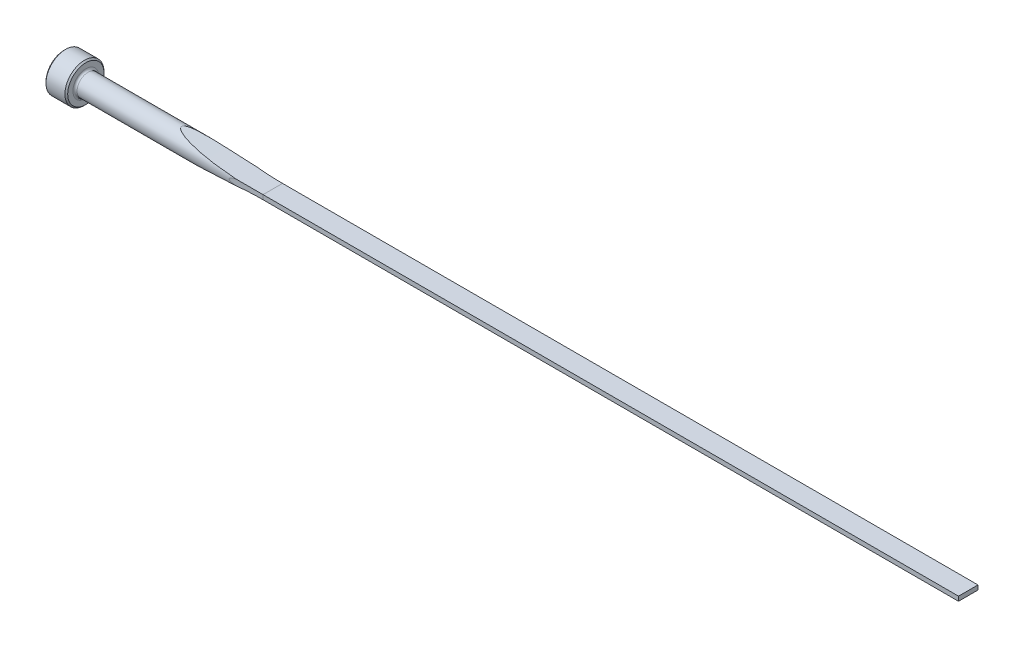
ISO-10303-21;
HEADER;
FILE_DESCRIPTION(('STEP AP214'),'2;1');
FILE_NAME('part.step','',(''),(''),'','','');
FILE_SCHEMA(('AUTOMOTIVE_DESIGN { 1 0 10303 214 1 1 1 1 }'));
ENDSEC;
DATA;
#1=APPLICATION_CONTEXT('core data for automotive mechanical design processes');
#2=APPLICATION_PROTOCOL_DEFINITION('international standard','automotive_design',2000,#1);
#3=PRODUCT_CONTEXT('',#1,'mechanical');
#4=PRODUCT('Part','Part','',(#3));
#5=PRODUCT_RELATED_PRODUCT_CATEGORY('part','',(#4));
#6=PRODUCT_DEFINITION_FORMATION('','',#4);
#7=PRODUCT_DEFINITION_CONTEXT('part definition',#1,'design');
#8=PRODUCT_DEFINITION('design','',#6,#7);
#9=PRODUCT_DEFINITION_SHAPE('','',#8);
#10=(LENGTH_UNIT() NAMED_UNIT(*) SI_UNIT(.MILLI.,.METRE.));
#11=(NAMED_UNIT(*) PLANE_ANGLE_UNIT() SI_UNIT($,.RADIAN.));
#12=(NAMED_UNIT(*) SI_UNIT($,.STERADIAN.) SOLID_ANGLE_UNIT());
#13=UNCERTAINTY_MEASURE_WITH_UNIT(LENGTH_MEASURE(1.E-05),#10,'distance_accuracy_value','');
#14=(GEOMETRIC_REPRESENTATION_CONTEXT(3) GLOBAL_UNCERTAINTY_ASSIGNED_CONTEXT((#13)) GLOBAL_UNIT_ASSIGNED_CONTEXT((#10,
#11,#12)) REPRESENTATION_CONTEXT('',''));
#15=CARTESIAN_POINT('',(0.,0.,0.));
#16=DIRECTION('',(0.,0.,1.));
#17=DIRECTION('',(1.,0.,0.));
#18=AXIS2_PLACEMENT_3D('',#15,#16,#17);
#19=CARTESIAN_POINT('',(0.,0.,0.));
#20=DIRECTION('',(-1.,0.,0.));
#21=DIRECTION('',(0.,0.,1.));
#22=AXIS2_PLACEMENT_3D('',#19,#20,#21);
#23=CYLINDRICAL_SURFACE('',#22,1.9812);
#24=CARTESIAN_POINT('',(4.3434,0.,0.));
#25=DIRECTION('',(-1.,0.,0.));
#26=DIRECTION('',(0.,0.,1.));
#27=AXIS2_PLACEMENT_3D('',#24,#25,#26);
#28=CIRCLE('',#27,1.9812);
#29=CARTESIAN_POINT('',(4.3434,0.,1.9812));
#30=VERTEX_POINT('',#29);
#31=EDGE_CURVE('E152',#30,#30,#28,.F.);
#32=ORIENTED_EDGE('',*,*,#31,.T.);
#33=EDGE_LOOP('',(#32));
#34=FACE_BOUND('',#33,.T.);
#35=CARTESIAN_POINT('',(38.1,0.873996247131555,1.77799999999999));
#36=CARTESIAN_POINT('',(37.9334542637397,0.873989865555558,1.77799993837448));
#37=CARTESIAN_POINT('',(37.7669097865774,0.873044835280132,1.77846802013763));
#38=CARTESIAN_POINT('',(37.4338428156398,0.869223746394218,1.78033991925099));
#39=CARTESIAN_POINT('',(37.2673203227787,0.866347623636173,1.78174376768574));
#40=CARTESIAN_POINT('',(36.7674068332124,0.854732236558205,1.78736286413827));
#41=CARTESIAN_POINT('',(36.4340948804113,0.8430056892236,1.7929856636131));
#42=CARTESIAN_POINT('',(35.7727863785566,0.810634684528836,1.80785962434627));
#43=CARTESIAN_POINT('',(35.4447825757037,0.79012144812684,1.81705721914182));
#44=CARTESIAN_POINT('',(34.9536671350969,0.750641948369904,1.83354371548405));
#45=CARTESIAN_POINT('',(34.7901577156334,0.736036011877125,1.83948544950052));
#46=CARTESIAN_POINT('',(34.4635315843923,0.703289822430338,1.85225599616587));
#47=CARTESIAN_POINT('',(34.3004148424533,0.685149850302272,1.85908473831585));
#48=CARTESIAN_POINT('',(34.0296562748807,0.651228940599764,1.87116478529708));
#49=CARTESIAN_POINT('',(33.9218452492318,0.636713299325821,1.8761721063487));
#50=CARTESIAN_POINT('',(33.7065408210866,0.605233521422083,1.88656384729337));
#51=CARTESIAN_POINT('',(33.5990475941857,0.588268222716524,1.8919484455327));
#52=CARTESIAN_POINT('',(33.3835275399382,0.551010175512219,1.9031350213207));
#53=CARTESIAN_POINT('',(33.2755064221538,0.530685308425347,1.90894069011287));
#54=CARTESIAN_POINT('',(33.0604889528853,0.485692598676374,1.92088824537));
#55=CARTESIAN_POINT('',(32.9534914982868,0.461030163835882,1.92702970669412));
#56=CARTESIAN_POINT('',(32.7938896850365,0.418829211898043,1.93647603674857));
#57=CARTESIAN_POINT('',(32.7406123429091,0.403818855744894,1.93967803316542));
#58=CARTESIAN_POINT('',(32.6346066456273,0.371424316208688,1.94614386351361));
#59=CARTESIAN_POINT('',(32.5818801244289,0.354033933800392,1.94940783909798));
#60=CARTESIAN_POINT('',(32.4782386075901,0.316094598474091,1.95591437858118));
#61=CARTESIAN_POINT('',(32.4273101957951,0.295581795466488,1.95915679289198));
#62=CARTESIAN_POINT('',(32.3278405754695,0.249491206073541,1.9655736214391));
#63=CARTESIAN_POINT('',(32.2792877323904,0.223942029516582,1.96874831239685));
#64=CARTESIAN_POINT('',(32.2167619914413,0.181702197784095,1.97288277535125));
#65=CARTESIAN_POINT('',(32.1999648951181,0.169297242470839,1.97399869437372));
#66=CARTESIAN_POINT('',(32.1681376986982,0.142414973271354,1.97612145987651));
#67=CARTESIAN_POINT('',(32.1530993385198,0.127948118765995,1.97712881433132));
#68=CARTESIAN_POINT('',(32.1334076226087,0.104576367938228,1.97845199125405));
#69=CARTESIAN_POINT('',(32.1274666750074,0.0967736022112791,1.97885188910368));
#70=CARTESIAN_POINT('',(32.116621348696,0.0804504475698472,1.97958282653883));
#71=CARTESIAN_POINT('',(32.1117177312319,0.0719295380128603,1.9799138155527));
#72=CARTESIAN_POINT('',(32.1032905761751,0.0540450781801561,1.9804831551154));
#73=CARTESIAN_POINT('',(32.0997893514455,0.0446706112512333,1.98072000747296));
#74=CARTESIAN_POINT('',(32.0947628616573,0.0254116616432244,1.98106017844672));
#75=CARTESIAN_POINT('',(32.0932312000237,0.0155289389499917,1.98116392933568));
#76=CARTESIAN_POINT('',(32.0924621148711,-0.00283989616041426,1.98121601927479));
#77=CARTESIAN_POINT('',(32.0929156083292,-0.0113136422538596,1.98118529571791));
#78=CARTESIAN_POINT('',(32.0953671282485,-0.0280374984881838,1.98101929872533));
#79=CARTESIAN_POINT('',(32.0973672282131,-0.0362872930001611,1.98088388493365));
#80=CARTESIAN_POINT('',(32.1032599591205,-0.0541083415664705,1.98048527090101));
#81=CARTESIAN_POINT('',(32.1074720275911,-0.0635712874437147,1.98020051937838));
#82=CARTESIAN_POINT('',(32.1173271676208,-0.081709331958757,1.97953524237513));
#83=CARTESIAN_POINT('',(32.1229731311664,-0.0903827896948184,1.97915452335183));
#84=CARTESIAN_POINT('',(32.1399709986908,-0.113337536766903,1.97801031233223));
#85=CARTESIAN_POINT('',(32.1523792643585,-0.126821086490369,1.97717711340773));
#86=CARTESIAN_POINT('',(32.178895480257,-0.151968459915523,1.97540307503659));
#87=CARTESIAN_POINT('',(32.1930088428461,-0.163626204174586,1.97446189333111));
#88=CARTESIAN_POINT('',(32.2308983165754,-0.19208509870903,1.97194504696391));
#89=CARTESIAN_POINT('',(32.2554459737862,-0.207842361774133,1.97032379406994));
#90=CARTESIAN_POINT('',(32.3058684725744,-0.237095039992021,1.96701597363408));
#91=CARTESIAN_POINT('',(32.331746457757,-0.250584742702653,1.9653292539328));
#92=CARTESIAN_POINT('',(32.4107777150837,-0.288767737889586,1.96021411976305));
#93=CARTESIAN_POINT('',(32.4650936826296,-0.311024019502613,1.95674636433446));
#94=CARTESIAN_POINT('',(32.5833217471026,-0.354812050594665,1.94931073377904));
#95=CARTESIAN_POINT('',(32.6474477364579,-0.375730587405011,1.94534614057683));
#96=CARTESIAN_POINT('',(32.7766973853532,-0.41429027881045,1.93749827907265));
#97=CARTESIAN_POINT('',(32.8418214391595,-0.431930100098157,1.93361504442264));
#98=CARTESIAN_POINT('',(33.0383860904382,-0.481456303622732,1.92211396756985));
#99=CARTESIAN_POINT('',(33.1707045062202,-0.509845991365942,1.91466459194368));
#100=CARTESIAN_POINT('',(33.4364278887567,-0.560951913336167,1.90030665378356));
#101=CARTESIAN_POINT('',(33.5698330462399,-0.583667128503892,1.89339818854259));
#102=CARTESIAN_POINT('',(33.8371090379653,-0.624985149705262,1.88016424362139));
#103=CARTESIAN_POINT('',(33.9709789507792,-0.643593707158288,1.87383795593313));
#104=CARTESIAN_POINT('',(34.2612886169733,-0.680513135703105,1.86077894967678));
#105=CARTESIAN_POINT('',(34.4178028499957,-0.698266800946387,1.85415178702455));
#106=CARTESIAN_POINT('',(34.7312113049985,-0.730437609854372,1.84171312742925));
#107=CARTESIAN_POINT('',(34.8881055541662,-0.744854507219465,1.83590169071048));
#108=CARTESIAN_POINT('',(35.3593917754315,-0.78401015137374,1.81969752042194));
#109=CARTESIAN_POINT('',(35.674170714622,-0.804628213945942,1.81054467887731));
#110=CARTESIAN_POINT('',(36.303676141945,-0.83743822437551,1.79559337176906));
#111=CARTESIAN_POINT('',(36.6184017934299,-0.849644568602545,1.78978917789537));
#112=CARTESIAN_POINT('',(37.2480072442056,-0.866841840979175,1.78152544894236));
#113=CARTESIAN_POINT('',(37.562886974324,-0.8718348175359,1.77906496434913));
#114=CARTESIAN_POINT('',(37.9518520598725,-0.8738064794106,1.77809255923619));
#115=CARTESIAN_POINT('',(38.0259264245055,-0.873993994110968,1.77799996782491));
#116=CARTESIAN_POINT('',(38.1,-0.873996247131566,1.77799999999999));
#117=B_SPLINE_CURVE_WITH_KNOTS('',3,(#35,#36,#37,#38,#39,#40,#41,#42,#43,#44,#45,#46,#47,#48,
#49,#50,#51,#52,#53,#54,#55,#56,#57,#58,#59,#60,#61,#62,#63,#64,#65,#66,#67,#68,#69,#70,#71,#72,
#73,#74,#75,#76,#77,#78,#79,#80,#81,#82,#83,#84,#85,#86,#87,#88,#89,#90,#91,#92,#93,#94,#95,#96,
#97,#98,#99,#100,#101,#102,#103,#104,#105,#106,#107,#108,#109,#110,#111,#112,#113,#114,#115,
#116),.UNSPECIFIED.,.F.,.F.,(4,2,2,2,2,2,2,2,2,2,2,2,2,2,2,2,2,2,2,2,2,2,2,2,2,2,2,2,2,2,2,2,2,
2,2,2,2,2,2,2,4),(0.,0.499631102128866,0.999278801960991,1.9998489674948,2.98597077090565,
3.47874557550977,3.97148123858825,4.29815737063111,4.62498898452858,4.95514810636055,
5.28489848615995,5.4512016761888,5.61794656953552,5.78289019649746,5.94692252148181,
6.00956538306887,6.07190109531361,6.10128690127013,6.1306941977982,6.1605523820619,
6.1903133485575,6.21561974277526,6.24096012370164,6.27187252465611,6.30284777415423,
6.35756673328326,6.41246418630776,6.49988097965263,6.58751479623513,6.76361391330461,
6.96621737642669,7.16890304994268,7.57526706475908,7.98170400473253,8.38756806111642,
8.86049226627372,9.33345136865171,10.2800238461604,11.2249722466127,12.1696522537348,
12.3918748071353),.UNSPECIFIED.);
#118=CARTESIAN_POINT('',(33.3055412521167,0.535778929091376,1.90737892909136));
#119=VERTEX_POINT('',#118);
#120=CARTESIAN_POINT('',(33.3055412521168,-0.535778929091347,1.90737892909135));
#121=VERTEX_POINT('',#120);
#122=EDGE_CURVE('E155',#119,#121,#117,.T.);
#123=ORIENTED_EDGE('',*,*,#122,.F.);
#124=CARTESIAN_POINT('',(38.1,0.406399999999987,1.93907000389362));
#125=CARTESIAN_POINT('',(37.7692956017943,0.406399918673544,1.93905843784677));
#126=CARTESIAN_POINT('',(37.4385913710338,0.408245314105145,1.93868298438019));
#127=CARTESIAN_POINT('',(36.7772104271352,0.415626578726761,1.93712001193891));
#128=CARTESIAN_POINT('',(36.4465337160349,0.421162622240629,1.93593245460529));
#129=CARTESIAN_POINT('',(35.7860594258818,0.435906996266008,1.93266489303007));
#130=CARTESIAN_POINT('',(35.456261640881,0.445106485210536,1.93058703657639));
#131=CARTESIAN_POINT('',(34.796814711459,0.467175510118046,1.92536360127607));
#132=CARTESIAN_POINT('',(34.4671655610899,0.480044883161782,1.92221806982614));
#133=CARTESIAN_POINT('',(33.4782152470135,0.524167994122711,1.9108535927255));
#134=CARTESIAN_POINT('',(32.8191651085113,0.560931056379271,1.90070770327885));
#135=CARTESIAN_POINT('',(31.8313681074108,0.627071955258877,1.87948200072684));
#136=CARTESIAN_POINT('',(31.5021769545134,0.650956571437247,1.87140376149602));
#137=CARTESIAN_POINT('',(30.8441537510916,0.702384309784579,1.85271790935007));
#138=CARTESIAN_POINT('',(30.5153216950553,0.729927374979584,1.84211033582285));
#139=CARTESIAN_POINT('',(29.8563841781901,0.788815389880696,1.81767575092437));
#140=CARTESIAN_POINT('',(29.5262810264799,0.82017942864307,1.8038322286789));
#141=CARTESIAN_POINT('',(28.8666409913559,0.886577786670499,1.77214226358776));
#142=CARTESIAN_POINT('',(28.5371040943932,0.921612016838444,1.75429591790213));
#143=CARTESIAN_POINT('',(27.8790189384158,0.995296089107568,1.71356755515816));
#144=CARTESIAN_POINT('',(27.5504700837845,1.03394288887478,1.69068975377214));
#145=CARTESIAN_POINT('',(26.8943469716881,1.11483240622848,1.63848108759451));
#146=CARTESIAN_POINT('',(26.5667726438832,1.15707485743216,1.6091507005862));
#147=CARTESIAN_POINT('',(25.9110283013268,1.2453472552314,1.54187804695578));
#148=CARTESIAN_POINT('',(25.5828658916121,1.29139778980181,1.50388671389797));
#149=CARTESIAN_POINT('',(25.0918351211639,1.36309382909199,1.43811303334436));
#150=CARTESIAN_POINT('',(24.9281937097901,1.38745545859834,1.41469558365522));
#151=CARTESIAN_POINT('',(24.6015940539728,1.43700653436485,1.3643380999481));
#152=CARTESIAN_POINT('',(24.4386357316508,1.46219588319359,1.33739847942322));
#153=CARTESIAN_POINT('',(24.1147309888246,1.51318307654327,1.27941902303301));
#154=CARTESIAN_POINT('',(23.9537784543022,1.53897548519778,1.24840893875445));
#155=CARTESIAN_POINT('',(23.6330248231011,1.59127560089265,1.18102348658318));
#156=CARTESIAN_POINT('',(23.4732243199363,1.61778364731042,1.14464553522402));
#157=CARTESIAN_POINT('',(23.1559514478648,1.67129760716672,1.06500559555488));
#158=CARTESIAN_POINT('',(22.9984731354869,1.69830158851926,1.02176672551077));
#159=CARTESIAN_POINT('',(22.7646367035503,1.73903791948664,0.94955302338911));
#160=CARTESIAN_POINT('',(22.687119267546,1.75264947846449,0.924267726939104));
#161=CARTESIAN_POINT('',(22.5331529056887,1.77989331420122,0.870657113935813));
#162=CARTESIAN_POINT('',(22.4567037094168,1.79352558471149,0.842332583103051));
#163=CARTESIAN_POINT('',(22.332862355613,1.81577325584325,0.792820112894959));
#164=CARTESIAN_POINT('',(22.2850144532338,1.82441008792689,0.772783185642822));
#165=CARTESIAN_POINT('',(22.1901094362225,1.84162019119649,0.730824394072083));
#166=CARTESIAN_POINT('',(22.1430526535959,1.85019343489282,0.708901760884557));
#167=CARTESIAN_POINT('',(22.0502093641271,1.86718431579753,0.662854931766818));
#168=CARTESIAN_POINT('',(22.0044188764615,1.87560240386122,0.638738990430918));
#169=CARTESIAN_POINT('',(21.9144099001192,1.89222058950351,0.587688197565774));
#170=CARTESIAN_POINT('',(21.8701903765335,1.90042082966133,0.560755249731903));
#171=CARTESIAN_POINT('',(21.7937216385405,1.91465872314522,0.509677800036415));
#172=CARTESIAN_POINT('',(21.7610069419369,1.92076989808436,0.486256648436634));
#173=CARTESIAN_POINT('',(21.6975363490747,1.93266121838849,0.436609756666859));
#174=CARTESIAN_POINT('',(21.6667856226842,1.93844048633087,0.410377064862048));
#175=CARTESIAN_POINT('',(21.6080567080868,1.94950726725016,0.354133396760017));
#176=CARTESIAN_POINT('',(21.5801166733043,1.95478796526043,0.32408045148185));
#177=CARTESIAN_POINT('',(21.5295061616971,1.96437466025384,0.259681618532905));
#178=CARTESIAN_POINT('',(21.506811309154,1.96868516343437,0.225356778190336));
#179=CARTESIAN_POINT('',(21.4781800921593,1.97413096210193,0.168450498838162));
#180=CARTESIAN_POINT('',(21.4692784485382,1.97582600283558,0.147430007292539));
#181=CARTESIAN_POINT('',(21.4548493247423,1.97857503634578,0.104216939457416));
#182=CARTESIAN_POINT('',(21.4493175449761,1.97962984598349,0.082025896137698));
#183=CARTESIAN_POINT('',(21.4421972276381,1.98098776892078,0.0368096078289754));
#184=CARTESIAN_POINT('',(21.4406380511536,1.98128528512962,0.0137794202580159));
#185=CARTESIAN_POINT('',(21.441756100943,1.98107199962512,-0.0321780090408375));
#186=CARTESIAN_POINT('',(21.4444344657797,1.9805609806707,-0.0551052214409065));
#187=CARTESIAN_POINT('',(21.4533059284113,1.97886943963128,-0.0982815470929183));
#188=CARTESIAN_POINT('',(21.4591973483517,1.97774638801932,-0.118597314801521));
#189=CARTESIAN_POINT('',(21.4737401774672,1.97497644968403,-0.15816238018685));
#190=CARTESIAN_POINT('',(21.4823927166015,1.97332934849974,-0.177411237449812));
#191=CARTESIAN_POINT('',(21.5089711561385,1.96827515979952,-0.228241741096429));
#192=CARTESIAN_POINT('',(21.5290704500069,1.96445818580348,-0.258638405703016));
#193=CARTESIAN_POINT('',(21.5734839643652,1.95604348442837,-0.316061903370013));
#194=CARTESIAN_POINT('',(21.597813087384,1.95144299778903,-0.34307622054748));
#195=CARTESIAN_POINT('',(21.6553284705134,1.94059533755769,-0.400355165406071));
#196=CARTESIAN_POINT('',(21.6892419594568,1.93421737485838,-0.429853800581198));
#197=CARTESIAN_POINT('',(21.7596931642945,1.92101412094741,-0.485462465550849));
#198=CARTESIAN_POINT('',(21.796235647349,1.9141880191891,-0.511566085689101));
#199=CARTESIAN_POINT('',(21.8712226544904,1.90023175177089,-0.561194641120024));
#200=CARTESIAN_POINT('',(21.9096756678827,1.89310025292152,-0.584706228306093));
#201=CARTESIAN_POINT('',(21.9877604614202,1.87867376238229,-0.629515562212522));
#202=CARTESIAN_POINT('',(22.0273911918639,1.87137891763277,-0.650815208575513));
#203=CARTESIAN_POINT('',(22.1371748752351,1.85125019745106,-0.706723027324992));
#204=CARTESIAN_POINT('',(22.2082257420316,1.83830961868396,-0.739524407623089));
#205=CARTESIAN_POINT('',(22.3520305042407,1.81230413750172,-0.801135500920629));
#206=CARTESIAN_POINT('',(22.4247854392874,1.79923916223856,-0.829942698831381));
#207=CARTESIAN_POINT('',(22.5715996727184,1.77306718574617,-0.884478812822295));
#208=CARTESIAN_POINT('',(22.6456613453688,1.75996015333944,-0.91020127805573));
#209=CARTESIAN_POINT('',(22.7946321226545,1.73379332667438,-0.95910350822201));
#210=CARTESIAN_POINT('',(22.8695413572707,1.72073354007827,-0.982282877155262));
#211=CARTESIAN_POINT('',(23.0955264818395,1.68163660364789,-1.0487695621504));
#212=CARTESIAN_POINT('',(23.2475553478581,1.65573619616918,-1.08891708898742));
#213=CARTESIAN_POINT('',(23.5529486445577,1.60453421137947,-1.16302666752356));
#214=CARTESIAN_POINT('',(23.7063109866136,1.57923187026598,-1.19699702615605));
#215=CARTESIAN_POINT('',(24.012684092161,1.529515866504,-1.25989153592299));
#216=CARTESIAN_POINT('',(24.1656849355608,1.50509614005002,-1.28885954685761));
#217=CARTESIAN_POINT('',(24.4724639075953,1.45695845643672,-1.34303071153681));
#218=CARTESIAN_POINT('',(24.6262420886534,1.43324054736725,-1.36823360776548));
#219=CARTESIAN_POINT('',(25.0885519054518,1.36318327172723,-1.4392148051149));
#220=CARTESIAN_POINT('',(25.397965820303,1.31795545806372,-1.48034746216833));
#221=CARTESIAN_POINT('',(26.0187821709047,1.23056531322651,-1.55373486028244));
#222=CARTESIAN_POINT('',(26.3301871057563,1.18840836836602,-1.5859742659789));
#223=CARTESIAN_POINT('',(26.9539875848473,1.10733360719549,-1.64360504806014));
#224=CARTESIAN_POINT('',(27.2663829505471,1.06841523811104,-1.66899759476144));
#225=CARTESIAN_POINT('',(27.8917260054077,0.993885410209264,-1.71442224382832));
#226=CARTESIAN_POINT('',(28.2046731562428,0.958271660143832,-1.73445807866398));
#227=CARTESIAN_POINT('',(28.8311773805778,0.890348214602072,-1.77028418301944));
#228=CARTESIAN_POINT('',(29.1447344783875,0.858038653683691,-1.78607427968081));
#229=CARTESIAN_POINT('',(29.7720592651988,0.796769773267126,-1.81423443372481));
#230=CARTESIAN_POINT('',(30.0858265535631,0.767807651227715,-1.82660736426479));
#231=CARTESIAN_POINT('',(30.7137483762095,0.713213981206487,-1.84860537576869));
#232=CARTESIAN_POINT('',(31.0279029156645,0.687582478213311,-1.85823041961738));
#233=CARTESIAN_POINT('',(31.8955164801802,0.62143910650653,-1.881751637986));
#234=CARTESIAN_POINT('',(32.4493088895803,0.584431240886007,-1.89333086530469));
#235=CARTESIAN_POINT('',(33.5576649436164,0.520785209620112,-1.91181175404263));
#236=CARTESIAN_POINT('',(34.1122287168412,0.494149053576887,-1.91871250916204));
#237=CARTESIAN_POINT('',(35.221372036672,0.45128601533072,-1.92924360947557));
#238=CARTESIAN_POINT('',(35.7759512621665,0.4350513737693,-1.9328763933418));
#239=CARTESIAN_POINT('',(36.8853230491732,0.41296746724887,-1.93771500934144));
#240=CARTESIAN_POINT('',(37.4401156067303,0.407118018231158,-1.93892088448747));
#241=CARTESIAN_POINT('',(38.0299343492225,0.406420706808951,-1.93906557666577));
#242=CARTESIAN_POINT('',(38.0649672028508,0.406399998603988,-1.93906990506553));
#243=CARTESIAN_POINT('',(38.1,0.406399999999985,-1.93907000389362));
#244=B_SPLINE_CURVE_WITH_KNOTS('',3,(#124,#125,#126,#127,#128,#129,#130,#131,#132,#133,#134,
#135,#136,#137,#138,#139,#140,#141,#142,#143,#144,#145,#146,#147,#148,#149,#150,#151,#152,#153,
#154,#155,#156,#157,#158,#159,#160,#161,#162,#163,#164,#165,#166,#167,#168,#169,#170,#171,#172,
#173,#174,#175,#176,#177,#178,#179,#180,#181,#182,#183,#184,#185,#186,#187,#188,#189,#190,#191,
#192,#193,#194,#195,#196,#197,#198,#199,#200,#201,#202,#203,#204,#205,#206,#207,#208,#209,#210,
#211,#212,#213,#214,#215,#216,#217,#218,#219,#220,#221,#222,#223,#224,#225,#226,#227,#228,#229,
#230,#231,#232,#233,#234,#235,#236,#237,#238,#239,#240,#241,#242,#243),.UNSPECIFIED.,.F.,.F.,(4,
2,2,2,2,2,2,2,2,2,2,2,2,2,2,2,2,2,2,2,2,2,2,2,2,2,2,2,2,2,2,2,2,2,2,2,2,2,2,2,2,2,2,2,2,2,2,2,2,
2,2,2,2,2,2,2,2,2,2,4),(0.,0.99210742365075,1.98426171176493,2.9740358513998,3.9637660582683,
5.94398815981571,6.93443174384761,7.92485990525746,8.92045633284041,9.91602859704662,
10.9107698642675,11.9054375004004,12.9058867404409,13.4071370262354,13.9083285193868,
14.4060419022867,14.9039956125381,15.4003057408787,15.6482581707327,15.8961466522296,
16.0538801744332,16.2116783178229,16.3689053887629,16.5260268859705,16.6480112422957,
16.7703044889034,16.8940810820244,17.0172703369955,17.0857086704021,17.1540594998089,
17.2229140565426,17.2917871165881,17.3550917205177,17.4184222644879,17.5277022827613,
17.6373754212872,17.773257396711,17.909392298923,18.0461983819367,18.1828859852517,
18.4206579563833,18.6585789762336,18.8969891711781,19.1354364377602,19.6133124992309,
20.0905410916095,20.5633457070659,21.0361826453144,21.9821441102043,22.9297267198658,
23.8771472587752,24.8239059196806,25.7707031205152,26.7167018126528,27.662713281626,
29.328020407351,30.9936500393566,32.6580356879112,34.3223918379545,34.4274903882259),.UNSPECIFIED.);
#245=CARTESIAN_POINT('',(33.3055412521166,0.535778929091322,-1.90737892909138));
#246=VERTEX_POINT('',#245);
#247=EDGE_CURVE('E105',#119,#246,#244,.T.);
#248=ORIENTED_EDGE('',*,*,#247,.T.);
#249=CARTESIAN_POINT('',(38.1,0.873996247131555,-1.77799999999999));
#250=CARTESIAN_POINT('',(37.9334542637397,0.873989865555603,-1.77799993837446));
#251=CARTESIAN_POINT('',(37.7669097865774,0.873044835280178,-1.77846802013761));
#252=CARTESIAN_POINT('',(37.4338428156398,0.869223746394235,-1.78033991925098));
#253=CARTESIAN_POINT('',(37.2673203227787,0.86634762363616,-1.78174376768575));
#254=CARTESIAN_POINT('',(36.7674068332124,0.854732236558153,-1.78736286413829));
#255=CARTESIAN_POINT('',(36.4340948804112,0.843005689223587,-1.7929856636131));
#256=CARTESIAN_POINT('',(35.7727863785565,0.81063468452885,-1.80785962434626));
#257=CARTESIAN_POINT('',(35.4447825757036,0.790121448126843,-1.81705721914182));
#258=CARTESIAN_POINT('',(34.9536671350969,0.750641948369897,-1.83354371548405));
#259=CARTESIAN_POINT('',(34.7901577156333,0.736036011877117,-1.83948544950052));
#260=CARTESIAN_POINT('',(34.4635315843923,0.703289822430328,-1.85225599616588));
#261=CARTESIAN_POINT('',(34.3004148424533,0.685149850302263,-1.85908473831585));
#262=CARTESIAN_POINT('',(34.0296562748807,0.651228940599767,-1.87116478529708));
#263=CARTESIAN_POINT('',(33.9218452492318,0.63671329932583,-1.8761721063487));
#264=CARTESIAN_POINT('',(33.7065408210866,0.605233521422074,-1.88656384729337));
#265=CARTESIAN_POINT('',(33.5990475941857,0.588268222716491,-1.89194844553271));
#266=CARTESIAN_POINT('',(33.3835275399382,0.551010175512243,-1.9031350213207));
#267=CARTESIAN_POINT('',(33.2755064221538,0.530685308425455,-1.90894069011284));
#268=CARTESIAN_POINT('',(33.0604889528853,0.485692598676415,-1.92088824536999));
#269=CARTESIAN_POINT('',(32.9534914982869,0.461030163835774,-1.92702970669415));
#270=CARTESIAN_POINT('',(32.7938896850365,0.418829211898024,-1.93647603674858));
#271=CARTESIAN_POINT('',(32.7406123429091,0.403818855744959,-1.93967803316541));
#272=CARTESIAN_POINT('',(32.6346066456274,0.37142431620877,-1.9461438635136));
#273=CARTESIAN_POINT('',(32.581880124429,0.354033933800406,-1.94940783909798));
#274=CARTESIAN_POINT('',(32.4782386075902,0.316094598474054,-1.95591437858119));
#275=CARTESIAN_POINT('',(32.4273101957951,0.295581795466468,-1.95915679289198));
#276=CARTESIAN_POINT('',(32.3278405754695,0.249491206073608,-1.96557362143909));
#277=CARTESIAN_POINT('',(32.2792877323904,0.223942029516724,-1.96874831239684));
#278=CARTESIAN_POINT('',(32.2167619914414,0.18170219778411,-1.97288277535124));
#279=CARTESIAN_POINT('',(32.1999648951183,0.169297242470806,-1.97399869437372));
#280=CARTESIAN_POINT('',(32.1681376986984,0.142414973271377,-1.97612145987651));
#281=CARTESIAN_POINT('',(32.15309933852,0.12794811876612,-1.97712881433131));
#282=CARTESIAN_POINT('',(32.1334076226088,0.104576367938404,-1.97845199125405));
#283=CARTESIAN_POINT('',(32.1274666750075,0.096773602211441,-1.97885188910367));
#284=CARTESIAN_POINT('',(32.1166213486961,0.0804504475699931,-1.97958282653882));
#285=CARTESIAN_POINT('',(32.1117177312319,0.0719295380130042,-1.9799138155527));
#286=CARTESIAN_POINT('',(32.1032905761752,0.0540450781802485,-1.9804831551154));
#287=CARTESIAN_POINT('',(32.0997893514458,0.0446706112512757,-1.98072000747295));
#288=CARTESIAN_POINT('',(32.0947628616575,0.0254116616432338,-1.98106017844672));
#289=CARTESIAN_POINT('',(32.0932312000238,0.015528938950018,-1.98116392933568));
#290=CARTESIAN_POINT('',(32.0924621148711,-0.00283989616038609,-1.98121601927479));
#291=CARTESIAN_POINT('',(32.0929156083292,-0.0113136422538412,-1.98118529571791));
#292=CARTESIAN_POINT('',(32.0953671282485,-0.0280374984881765,-1.98101929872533));
#293=CARTESIAN_POINT('',(32.0973672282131,-0.0362872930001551,-1.98088388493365));
#294=CARTESIAN_POINT('',(32.1032599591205,-0.0541083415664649,-1.98048527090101));
#295=CARTESIAN_POINT('',(32.1074720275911,-0.0635712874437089,-1.98020051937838));
#296=CARTESIAN_POINT('',(32.1173271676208,-0.0817093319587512,-1.97953524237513));
#297=CARTESIAN_POINT('',(32.1229731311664,-0.0903827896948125,-1.97915452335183));
#298=CARTESIAN_POINT('',(32.1399709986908,-0.1133375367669,-1.97801031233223));
#299=CARTESIAN_POINT('',(32.1523792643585,-0.126821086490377,-1.97717711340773));
#300=CARTESIAN_POINT('',(32.1788954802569,-0.151968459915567,-1.97540307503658));
#301=CARTESIAN_POINT('',(32.193008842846,-0.163626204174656,-1.9744618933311));
#302=CARTESIAN_POINT('',(32.2308983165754,-0.192085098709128,-1.9719450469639));
#303=CARTESIAN_POINT('',(32.2554459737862,-0.207842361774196,-1.97032379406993));
#304=CARTESIAN_POINT('',(32.3058684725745,-0.237095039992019,-1.96701597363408));
#305=CARTESIAN_POINT('',(32.3317464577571,-0.250584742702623,-1.96532925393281));
#306=CARTESIAN_POINT('',(32.4107777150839,-0.288767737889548,-1.96021411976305));
#307=CARTESIAN_POINT('',(32.4650936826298,-0.311024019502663,-1.95674636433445));
#308=CARTESIAN_POINT('',(32.583321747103,-0.354812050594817,-1.94931073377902));
#309=CARTESIAN_POINT('',(32.6474477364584,-0.375730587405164,-1.9453461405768));
#310=CARTESIAN_POINT('',(32.7766973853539,-0.414290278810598,-1.93749827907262));
#311=CARTESIAN_POINT('',(32.8418214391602,-0.431930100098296,-1.93361504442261));
#312=CARTESIAN_POINT('',(33.0383860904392,-0.48145630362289,-1.92211396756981));
#313=CARTESIAN_POINT('',(33.1707045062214,-0.509845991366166,-1.91466459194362));
#314=CARTESIAN_POINT('',(33.4364278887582,-0.560951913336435,-1.90030665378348));
#315=CARTESIAN_POINT('',(33.5698330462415,-0.583667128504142,-1.89339818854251));
#316=CARTESIAN_POINT('',(33.8371090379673,-0.624985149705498,-1.88016424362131));
#317=CARTESIAN_POINT('',(33.9709789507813,-0.643593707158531,-1.87383795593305));
#318=CARTESIAN_POINT('',(34.2612886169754,-0.680513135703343,-1.86077894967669));
#319=CARTESIAN_POINT('',(34.4178028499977,-0.698266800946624,-1.85415178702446));
#320=CARTESIAN_POINT('',(34.7312113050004,-0.730437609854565,-1.84171312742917));
#321=CARTESIAN_POINT('',(34.888105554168,-0.744854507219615,-1.83590169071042));
#322=CARTESIAN_POINT('',(35.359391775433,-0.784010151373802,-1.81969752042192));
#323=CARTESIAN_POINT('',(35.6741707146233,-0.804628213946,-1.81054467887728));
#324=CARTESIAN_POINT('',(36.3036761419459,-0.83743822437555,-1.79559337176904));
#325=CARTESIAN_POINT('',(36.6184017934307,-0.849644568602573,-1.78978917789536));
#326=CARTESIAN_POINT('',(37.2480072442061,-0.866841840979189,-1.78152544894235));
#327=CARTESIAN_POINT('',(37.5628869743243,-0.871834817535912,-1.77906496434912));
#328=CARTESIAN_POINT('',(37.9518520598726,-0.87380647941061,-1.77809255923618));
#329=CARTESIAN_POINT('',(38.0259264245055,-0.873993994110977,-1.7779999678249));
#330=CARTESIAN_POINT('',(38.1,-0.873996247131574,-1.77799999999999));
#331=B_SPLINE_CURVE_WITH_KNOTS('',3,(#249,#250,#251,#252,#253,#254,#255,#256,#257,#258,#259,
#260,#261,#262,#263,#264,#265,#266,#267,#268,#269,#270,#271,#272,#273,#274,#275,#276,#277,#278,
#279,#280,#281,#282,#283,#284,#285,#286,#287,#288,#289,#290,#291,#292,#293,#294,#295,#296,#297,
#298,#299,#300,#301,#302,#303,#304,#305,#306,#307,#308,#309,#310,#311,#312,#313,#314,#315,#316,
#317,#318,#319,#320,#321,#322,#323,#324,#325,#326,#327,#328,#329,#330),.UNSPECIFIED.,.F.,.F.,(4,
2,2,2,2,2,2,2,2,2,2,2,2,2,2,2,2,2,2,2,2,2,2,2,2,2,2,2,2,2,2,2,2,2,2,2,2,2,2,2,4),(0.,
0.499631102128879,0.99927880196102,1.99984896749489,2.98597077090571,3.4787455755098,
3.97148123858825,4.29815737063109,4.62498898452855,4.95514810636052,5.28489848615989,
5.45120167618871,5.61794656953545,5.7828901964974,5.94692252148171,6.00956538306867,
6.07190109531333,6.1012869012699,6.13069419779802,6.16055238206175,6.19031334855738,
6.21561974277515,6.24096012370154,6.27187252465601,6.30284777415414,6.35756673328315,
6.41246418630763,6.49988097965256,6.58751479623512,6.7636139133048,6.96621737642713,
7.16890304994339,7.57526706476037,7.98170400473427,8.38756806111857,8.8604922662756,
9.33345136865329,10.2800238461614,11.2249722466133,12.1696522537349,12.3918748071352),.UNSPECIFIED.);
#332=CARTESIAN_POINT('',(33.3055412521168,-0.535778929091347,-1.90737892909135));
#333=VERTEX_POINT('',#332);
#334=EDGE_CURVE('E174',#246,#333,#331,.T.);
#335=ORIENTED_EDGE('',*,*,#334,.T.);
#336=CARTESIAN_POINT('',(38.1,-0.406399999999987,1.93907000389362));
#337=CARTESIAN_POINT('',(37.7692956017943,-0.406399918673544,1.93905843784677));
#338=CARTESIAN_POINT('',(37.4385913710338,-0.408245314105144,1.93868298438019));
#339=CARTESIAN_POINT('',(36.7772104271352,-0.415626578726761,1.93712001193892));
#340=CARTESIAN_POINT('',(36.4465337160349,-0.421162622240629,1.93593245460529));
#341=CARTESIAN_POINT('',(35.7860594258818,-0.435906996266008,1.93266489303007));
#342=CARTESIAN_POINT('',(35.456261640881,-0.445106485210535,1.93058703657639));
#343=CARTESIAN_POINT('',(34.796814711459,-0.467175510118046,1.92536360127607));
#344=CARTESIAN_POINT('',(34.46716556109,-0.480044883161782,1.92221806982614));
#345=CARTESIAN_POINT('',(33.4782152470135,-0.524167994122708,1.9108535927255));
#346=CARTESIAN_POINT('',(32.8191651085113,-0.56093105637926,1.90070770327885));
#347=CARTESIAN_POINT('',(31.8313681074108,-0.627071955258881,1.87948200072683));
#348=CARTESIAN_POINT('',(31.5021769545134,-0.650956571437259,1.87140376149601));
#349=CARTESIAN_POINT('',(30.8441537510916,-0.702384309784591,1.85271790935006));
#350=CARTESIAN_POINT('',(30.5153216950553,-0.729927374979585,1.84211033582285));
#351=CARTESIAN_POINT('',(29.8563841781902,-0.788815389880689,1.81767575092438));
#352=CARTESIAN_POINT('',(29.5262810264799,-0.820179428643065,1.80383222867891));
#353=CARTESIAN_POINT('',(28.8666409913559,-0.886577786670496,1.77214226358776));
#354=CARTESIAN_POINT('',(28.5371040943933,-0.92161201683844,1.75429591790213));
#355=CARTESIAN_POINT('',(27.8790189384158,-0.995296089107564,1.71356755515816));
#356=CARTESIAN_POINT('',(27.5504700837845,-1.03394288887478,1.69068975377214));
#357=CARTESIAN_POINT('',(26.8943469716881,-1.11483240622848,1.63848108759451));
#358=CARTESIAN_POINT('',(26.5667726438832,-1.15707485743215,1.6091507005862));
#359=CARTESIAN_POINT('',(25.9110283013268,-1.2453472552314,1.54187804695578));
#360=CARTESIAN_POINT('',(25.5828658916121,-1.29139778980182,1.50388671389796));
#361=CARTESIAN_POINT('',(25.091835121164,-1.36309382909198,1.43811303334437));
#362=CARTESIAN_POINT('',(24.9281937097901,-1.38745545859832,1.41469558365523));
#363=CARTESIAN_POINT('',(24.6015940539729,-1.43700653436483,1.36433809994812));
#364=CARTESIAN_POINT('',(24.4386357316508,-1.46219588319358,1.33739847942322));
#365=CARTESIAN_POINT('',(24.1147309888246,-1.51318307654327,1.27941902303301));
#366=CARTESIAN_POINT('',(23.9537784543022,-1.53897548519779,1.24840893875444));
#367=CARTESIAN_POINT('',(23.6330248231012,-1.59127560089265,1.18102348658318));
#368=CARTESIAN_POINT('',(23.4732243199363,-1.61778364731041,1.14464553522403));
#369=CARTESIAN_POINT('',(23.1559514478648,-1.67129760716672,1.06500559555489));
#370=CARTESIAN_POINT('',(22.9984731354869,-1.69830158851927,1.02176672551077));
#371=CARTESIAN_POINT('',(22.7646367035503,-1.73903791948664,0.949553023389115));
#372=CARTESIAN_POINT('',(22.687119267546,-1.75264947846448,0.924267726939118));
#373=CARTESIAN_POINT('',(22.5331529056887,-1.77989331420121,0.870657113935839));
#374=CARTESIAN_POINT('',(22.4567037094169,-1.79352558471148,0.84233258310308));
#375=CARTESIAN_POINT('',(22.332862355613,-1.81577325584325,0.792820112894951));
#376=CARTESIAN_POINT('',(22.2850144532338,-1.8244100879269,0.772783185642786));
#377=CARTESIAN_POINT('',(22.1901094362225,-1.8416201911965,0.730824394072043));
#378=CARTESIAN_POINT('',(22.1430526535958,-1.85019343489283,0.708901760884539));
#379=CARTESIAN_POINT('',(22.0502093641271,-1.86718431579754,0.662854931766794));
#380=CARTESIAN_POINT('',(22.0044188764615,-1.87560240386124,0.638738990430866));
#381=CARTESIAN_POINT('',(21.9144099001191,-1.89222058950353,0.587688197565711));
#382=CARTESIAN_POINT('',(21.8701903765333,-1.90042082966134,0.560755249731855));
#383=CARTESIAN_POINT('',(21.7937216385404,-1.91465872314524,0.509677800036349));
#384=CARTESIAN_POINT('',(21.7610069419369,-1.92076989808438,0.486256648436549));
#385=CARTESIAN_POINT('',(21.6975363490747,-1.9326612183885,0.4366097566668));
#386=CARTESIAN_POINT('',(21.6667856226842,-1.93844048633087,0.410377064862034));
#387=CARTESIAN_POINT('',(21.6080567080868,-1.94950726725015,0.354133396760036));
#388=CARTESIAN_POINT('',(21.5801166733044,-1.95478796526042,0.324080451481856));
#389=CARTESIAN_POINT('',(21.5295061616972,-1.96437466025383,0.259681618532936));
#390=CARTESIAN_POINT('',(21.5068113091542,-1.96868516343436,0.225356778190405));
#391=CARTESIAN_POINT('',(21.4781800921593,-1.97413096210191,0.168450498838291));
#392=CARTESIAN_POINT('',(21.4692784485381,-1.97582600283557,0.147430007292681));
#393=CARTESIAN_POINT('',(21.4548493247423,-1.97857503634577,0.104216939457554));
#394=CARTESIAN_POINT('',(21.4493175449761,-1.97962984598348,0.0820258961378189));
#395=CARTESIAN_POINT('',(21.4421972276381,-1.98098776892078,0.0368096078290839));
#396=CARTESIAN_POINT('',(21.4406380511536,-1.98128528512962,0.013779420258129));
#397=CARTESIAN_POINT('',(21.441756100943,-1.98107199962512,-0.0321780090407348));
#398=CARTESIAN_POINT('',(21.4444344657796,-1.9805609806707,-0.0551052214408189));
#399=CARTESIAN_POINT('',(21.4533059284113,-1.97886943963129,-0.0982815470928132));
#400=CARTESIAN_POINT('',(21.4591973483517,-1.97774638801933,-0.118597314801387));
#401=CARTESIAN_POINT('',(21.4737401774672,-1.97497644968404,-0.158162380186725));
#402=CARTESIAN_POINT('',(21.4823927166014,-1.97332934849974,-0.177411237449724));
#403=CARTESIAN_POINT('',(21.5089711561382,-1.96827515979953,-0.228241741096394));
#404=CARTESIAN_POINT('',(21.5290704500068,-1.96445818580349,-0.258638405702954));
#405=CARTESIAN_POINT('',(21.573483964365,-1.95604348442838,-0.316061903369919));
#406=CARTESIAN_POINT('',(21.5978130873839,-1.95144299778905,-0.343076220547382));
#407=CARTESIAN_POINT('',(21.6553284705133,-1.94059533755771,-0.400355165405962));
#408=CARTESIAN_POINT('',(21.6892419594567,-1.93421737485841,-0.429853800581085));
#409=CARTESIAN_POINT('',(21.7596931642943,-1.92101412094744,-0.485462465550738));
#410=CARTESIAN_POINT('',(21.7962356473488,-1.91418801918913,-0.511566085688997));
#411=CARTESIAN_POINT('',(21.8712226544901,-1.90023175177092,-0.561194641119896));
#412=CARTESIAN_POINT('',(21.9096756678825,-1.89310025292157,-0.584706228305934));
#413=CARTESIAN_POINT('',(21.9877604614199,-1.87867376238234,-0.629515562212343));
#414=CARTESIAN_POINT('',(22.0273911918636,-1.87137891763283,-0.650815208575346));
#415=CARTESIAN_POINT('',(22.1371748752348,-1.85125019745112,-0.706723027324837));
#416=CARTESIAN_POINT('',(22.2082257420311,-1.83830961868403,-0.739524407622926));
#417=CARTESIAN_POINT('',(22.3520305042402,-1.81230413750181,-0.801135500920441));
#418=CARTESIAN_POINT('',(22.4247854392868,-1.79923916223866,-0.829942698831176));
#419=CARTESIAN_POINT('',(22.5715996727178,-1.77306718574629,-0.884478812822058));
#420=CARTESIAN_POINT('',(22.6456613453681,-1.75996015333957,-0.91020127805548));
#421=CARTESIAN_POINT('',(22.7946321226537,-1.73379332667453,-0.959103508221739));
#422=CARTESIAN_POINT('',(22.8695413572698,-1.72073354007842,-0.982282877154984));
#423=CARTESIAN_POINT('',(23.0955264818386,-1.68163660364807,-1.04876956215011));
#424=CARTESIAN_POINT('',(23.247555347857,-1.65573619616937,-1.08891708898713));
#425=CARTESIAN_POINT('',(23.5529486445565,-1.60453421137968,-1.16302666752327));
#426=CARTESIAN_POINT('',(23.7063109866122,-1.5792318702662,-1.19699702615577));
#427=CARTESIAN_POINT('',(24.0126840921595,-1.52951586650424,-1.2598915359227));
#428=CARTESIAN_POINT('',(24.1656849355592,-1.50509614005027,-1.28885954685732));
#429=CARTESIAN_POINT('',(24.4724639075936,-1.456958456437,-1.3430307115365));
#430=CARTESIAN_POINT('',(24.6262420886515,-1.43324054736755,-1.36823360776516));
#431=CARTESIAN_POINT('',(25.0885519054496,-1.36318327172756,-1.43921480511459));
#432=CARTESIAN_POINT('',(25.3979658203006,-1.31795545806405,-1.48034746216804));
#433=CARTESIAN_POINT('',(26.018782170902,-1.23056531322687,-1.55373486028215));
#434=CARTESIAN_POINT('',(26.3301871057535,-1.18840836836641,-1.58597426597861));
#435=CARTESIAN_POINT('',(26.9539875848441,-1.10733360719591,-1.64360504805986));
#436=CARTESIAN_POINT('',(27.2663829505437,-1.06841523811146,-1.66899759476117));
#437=CARTESIAN_POINT('',(27.8917260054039,-0.993885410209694,-1.71442224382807));
#438=CARTESIAN_POINT('',(28.2046731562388,-0.958271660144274,-1.73445807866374));
#439=CARTESIAN_POINT('',(28.8311773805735,-0.890348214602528,-1.77028418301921));
#440=CARTESIAN_POINT('',(29.1447344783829,-0.85803865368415,-1.78607427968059));
#441=CARTESIAN_POINT('',(29.7720592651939,-0.796769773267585,-1.8142344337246));
#442=CARTESIAN_POINT('',(30.085826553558,-0.767807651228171,-1.8266073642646));
#443=CARTESIAN_POINT('',(30.713748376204,-0.713213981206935,-1.84860537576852));
#444=CARTESIAN_POINT('',(31.0279029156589,-0.687582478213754,-1.85823041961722));
#445=CARTESIAN_POINT('',(31.8955164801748,-0.621439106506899,-1.88175163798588));
#446=CARTESIAN_POINT('',(32.4493088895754,-0.584431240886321,-1.89333086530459));
#447=CARTESIAN_POINT('',(33.5576649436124,-0.520785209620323,-1.91181175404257));
#448=CARTESIAN_POINT('',(34.1122287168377,-0.49414905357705,-1.918712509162));
#449=CARTESIAN_POINT('',(35.2213720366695,-0.451286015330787,-1.92924360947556));
#450=CARTESIAN_POINT('',(35.7759512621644,-0.435051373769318,-1.93287639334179));
#451=CARTESIAN_POINT('',(36.8853230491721,-0.412967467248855,-1.93771500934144));
#452=CARTESIAN_POINT('',(37.4401156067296,-0.407118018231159,-1.93892088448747));
#453=CARTESIAN_POINT('',(38.0299343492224,-0.406420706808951,-1.93906557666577));
#454=CARTESIAN_POINT('',(38.0649672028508,-0.406399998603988,-1.93906990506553));
#455=CARTESIAN_POINT('',(38.1,-0.406399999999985,-1.93907000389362));
#456=B_SPLINE_CURVE_WITH_KNOTS('',3,(#336,#337,#338,#339,#340,#341,#342,#343,#344,#345,#346,
#347,#348,#349,#350,#351,#352,#353,#354,#355,#356,#357,#358,#359,#360,#361,#362,#363,#364,#365,
#366,#367,#368,#369,#370,#371,#372,#373,#374,#375,#376,#377,#378,#379,#380,#381,#382,#383,#384,
#385,#386,#387,#388,#389,#390,#391,#392,#393,#394,#395,#396,#397,#398,#399,#400,#401,#402,#403,
#404,#405,#406,#407,#408,#409,#410,#411,#412,#413,#414,#415,#416,#417,#418,#419,#420,#421,#422,
#423,#424,#425,#426,#427,#428,#429,#430,#431,#432,#433,#434,#435,#436,#437,#438,#439,#440,#441,
#442,#443,#444,#445,#446,#447,#448,#449,#450,#451,#452,#453,#454,#455),.UNSPECIFIED.,.F.,.F.,(4,
2,2,2,2,2,2,2,2,2,2,2,2,2,2,2,2,2,2,2,2,2,2,2,2,2,2,2,2,2,2,2,2,2,2,2,2,2,2,2,2,2,2,2,2,2,2,2,2,
2,2,2,2,2,2,2,2,2,2,4),(0.,0.99210742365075,1.98426171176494,2.9740358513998,3.9637660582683,
5.94398815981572,6.93443174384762,7.92485990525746,8.92045633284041,9.91602859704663,
10.9107698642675,11.9054375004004,12.9058867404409,13.4071370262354,13.9083285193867,
14.4060419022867,14.9039956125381,15.4003057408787,15.6482581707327,15.8961466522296,
16.0538801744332,16.211678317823,16.368905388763,16.5260268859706,16.6480112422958,
16.7703044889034,16.8940810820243,17.0172703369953,17.085708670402,17.1540594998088,
17.2229140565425,17.2917871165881,17.3550917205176,17.4184222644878,17.5277022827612,
17.637375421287,17.7732573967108,17.9093922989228,18.0461983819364,18.1828859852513,
18.4206579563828,18.6585789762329,18.8969891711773,19.1354364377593,19.6133124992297,
20.0905410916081,20.5633457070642,21.0361826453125,21.9821441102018,22.9297267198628,
23.8771472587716,24.8239059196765,25.7707031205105,26.7167018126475,27.6627132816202,
29.3280204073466,30.9936500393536,32.6580356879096,34.3223918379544,34.427490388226),.UNSPECIFIED.);
#457=EDGE_CURVE('E104',#121,#333,#456,.T.);
#458=ORIENTED_EDGE('',*,*,#457,.F.);
#459=EDGE_LOOP('',(#123,#248,#335,#458));
#460=FACE_BOUND('',#459,.T.);
#461=ADVANCED_FACE('F32',(#34,#460),#23,.T.);
#462=CARTESIAN_POINT('',(165.1,1.9812,0.));
#463=DIRECTION('',(-1.,0.,0.));
#464=DIRECTION('',(0.,0.,1.));
#465=AXIS2_PLACEMENT_3D('',#462,#463,#464);
#466=PLANE('',#465);
#467=DIRECTION('',(0.,1.,0.));
#468=VECTOR('',#467,1.);
#469=CARTESIAN_POINT('',(165.1,-3.5687,1.778));
#470=LINE('',#469,#468);
#471=CARTESIAN_POINT('',(165.1,-0.4064,1.778));
#472=VERTEX_POINT('',#471);
#473=CARTESIAN_POINT('',(165.1,0.4064,1.778));
#474=VERTEX_POINT('',#473);
#475=EDGE_CURVE('E86',#472,#474,#470,.T.);
#476=ORIENTED_EDGE('',*,*,#475,.F.);
#477=DIRECTION('',(0.,0.,1.));
#478=VECTOR('',#477,1.);
#479=CARTESIAN_POINT('',(165.1,-0.4064,0.));
#480=LINE('',#479,#478);
#481=CARTESIAN_POINT('',(165.1,-0.4064,-1.77799999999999));
#482=VERTEX_POINT('',#481);
#483=EDGE_CURVE('E99',#482,#472,#480,.T.);
#484=ORIENTED_EDGE('',*,*,#483,.F.);
#485=DIRECTION('',(0.,1.,0.));
#486=VECTOR('',#485,1.);
#487=CARTESIAN_POINT('',(165.1,-3.5687,-1.778));
#488=LINE('',#487,#486);
#489=CARTESIAN_POINT('',(165.1,0.406399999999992,-1.778));
#490=VERTEX_POINT('',#489);
#491=EDGE_CURVE('E55',#482,#490,#488,.T.);
#492=ORIENTED_EDGE('',*,*,#491,.T.);
#493=DIRECTION('',(0.,0.,1.));
#494=VECTOR('',#493,1.);
#495=CARTESIAN_POINT('',(165.1,0.4064,0.));
#496=LINE('',#495,#494);
#497=EDGE_CURVE('E101',#490,#474,#496,.T.);
#498=ORIENTED_EDGE('',*,*,#497,.T.);
#499=EDGE_LOOP('',(#476,#484,#492,#498));
#500=FACE_BOUND('',#499,.T.);
#501=ADVANCED_FACE('F98',(#500),#466,.F.);
#502=CARTESIAN_POINT('',(38.1,89.3064,-3.5687));
#503=DIRECTION('',(0.,0.,1.));
#504=DIRECTION('',(1.,0.,0.));
#505=AXIS2_PLACEMENT_3D('',#502,#503,#504);
#506=CYLINDRICAL_SURFACE('',#505,88.9);
#507=CARTESIAN_POINT('',(38.1,89.3064,90.678));
#508=DIRECTION('',(0.,-0.707106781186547,0.707106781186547));
#509=DIRECTION('',(0.,0.707106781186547,0.707106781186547));
#510=AXIS2_PLACEMENT_3D('',#507,#508,#509);
#511=ELLIPSE('',#510,125.723585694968,88.9);
#512=CARTESIAN_POINT('',(38.1,0.406399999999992,1.77799999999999));
#513=VERTEX_POINT('',#512);
#514=EDGE_CURVE('E161',#513,#119,#511,.F.);
#515=ORIENTED_EDGE('',*,*,#514,.F.);
#516=DIRECTION('',(0.,0.,1.));
#517=VECTOR('',#516,1.);
#518=CARTESIAN_POINT('',(38.1,0.406399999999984,-3.5687));
#519=LINE('',#518,#517);
#520=CARTESIAN_POINT('',(38.1,0.406399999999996,-1.77799999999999));
#521=VERTEX_POINT('',#520);
#522=EDGE_CURVE('E169',#521,#513,#519,.T.);
#523=ORIENTED_EDGE('',*,*,#522,.F.);
#524=CARTESIAN_POINT('',(38.1,89.3064,-90.678));
#525=DIRECTION('',(0.,0.707106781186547,0.707106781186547));
#526=DIRECTION('',(0.,-0.707106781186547,0.707106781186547));
#527=AXIS2_PLACEMENT_3D('',#524,#525,#526);
#528=ELLIPSE('',#527,125.723585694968,88.9);
#529=EDGE_CURVE('E168',#521,#246,#528,.F.);
#530=ORIENTED_EDGE('',*,*,#529,.T.);
#531=ORIENTED_EDGE('',*,*,#247,.F.);
#532=EDGE_LOOP('',(#515,#523,#530,#531));
#533=FACE_BOUND('',#532,.T.);
#534=ADVANCED_FACE('F137',(#533),#506,.F.);
#535=CARTESIAN_POINT('',(165.1,0.4064,-3.5687));
#536=DIRECTION('',(0.,-1.,0.));
#537=DIRECTION('',(1.,0.,0.));
#538=AXIS2_PLACEMENT_3D('',#535,#536,#537);
#539=PLANE('',#538);
#540=DIRECTION('',(-1.,0.,0.));
#541=VECTOR('',#540,1.);
#542=CARTESIAN_POINT('',(165.1,0.4064,1.778));
#543=LINE('',#542,#541);
#544=EDGE_CURVE('E187',#474,#513,#543,.T.);
#545=ORIENTED_EDGE('',*,*,#544,.F.);
#546=ORIENTED_EDGE('',*,*,#497,.F.);
#547=DIRECTION('',(-1.,0.,0.));
#548=VECTOR('',#547,1.);
#549=CARTESIAN_POINT('',(165.1,0.4064,-1.778));
#550=LINE('',#549,#548);
#551=EDGE_CURVE('E173',#490,#521,#550,.T.);
#552=ORIENTED_EDGE('',*,*,#551,.T.);
#553=ORIENTED_EDGE('',*,*,#522,.T.);
#554=EDGE_LOOP('',(#545,#546,#552,#553));
#555=FACE_BOUND('',#554,.T.);
#556=ADVANCED_FACE('F128',(#555),#539,.F.);
#557=CARTESIAN_POINT('',(38.1,-89.3064,-3.5687));
#558=DIRECTION('',(0.,0.,1.));
#559=DIRECTION('',(1.,0.,0.));
#560=AXIS2_PLACEMENT_3D('',#557,#558,#559);
#561=CYLINDRICAL_SURFACE('',#560,88.9);
#562=DIRECTION('',(0.,0.,1.));
#563=VECTOR('',#562,1.);
#564=CARTESIAN_POINT('',(38.1,-0.406399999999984,-3.5687));
#565=LINE('',#564,#563);
#566=CARTESIAN_POINT('',(38.1,-0.406399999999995,-1.77799999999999));
#567=VERTEX_POINT('',#566);
#568=CARTESIAN_POINT('',(38.1,-0.406399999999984,1.77799999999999));
#569=VERTEX_POINT('',#568);
#570=EDGE_CURVE('E177',#567,#569,#565,.T.);
#571=ORIENTED_EDGE('',*,*,#570,.T.);
#572=CARTESIAN_POINT('',(38.1,-89.3064,90.678));
#573=DIRECTION('',(0.,0.707106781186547,0.707106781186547));
#574=DIRECTION('',(0.,-0.707106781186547,0.707106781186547));
#575=AXIS2_PLACEMENT_3D('',#572,#573,#574);
#576=ELLIPSE('',#575,125.723585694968,88.9);
#577=EDGE_CURVE('E162',#569,#121,#576,.T.);
#578=ORIENTED_EDGE('',*,*,#577,.T.);
#579=ORIENTED_EDGE('',*,*,#457,.T.);
#580=CARTESIAN_POINT('',(38.1,-89.3064,-90.678));
#581=DIRECTION('',(0.,-0.707106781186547,0.707106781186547));
#582=DIRECTION('',(0.,0.707106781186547,0.707106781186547));
#583=AXIS2_PLACEMENT_3D('',#580,#581,#582);
#584=ELLIPSE('',#583,125.723585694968,88.9);
#585=EDGE_CURVE('E179',#567,#333,#584,.T.);
#586=ORIENTED_EDGE('',*,*,#585,.F.);
#587=EDGE_LOOP('',(#571,#578,#579,#586));
#588=FACE_BOUND('',#587,.T.);
#589=ADVANCED_FACE('F123',(#588),#561,.F.);
#590=CARTESIAN_POINT('',(165.1,-0.4064,-3.5687));
#591=DIRECTION('',(0.,-1.,0.));
#592=DIRECTION('',(1.,0.,0.));
#593=AXIS2_PLACEMENT_3D('',#590,#591,#592);
#594=PLANE('',#593);
#595=ORIENTED_EDGE('',*,*,#483,.T.);
#596=DIRECTION('',(-1.,0.,0.));
#597=VECTOR('',#596,1.);
#598=CARTESIAN_POINT('',(165.1,-0.4064,1.778));
#599=LINE('',#598,#597);
#600=EDGE_CURVE('E83',#472,#569,#599,.T.);
#601=ORIENTED_EDGE('',*,*,#600,.T.);
#602=ORIENTED_EDGE('',*,*,#570,.F.);
#603=DIRECTION('',(-1.,0.,0.));
#604=VECTOR('',#603,1.);
#605=CARTESIAN_POINT('',(165.1,-0.4064,-1.778));
#606=LINE('',#605,#604);
#607=EDGE_CURVE('E93',#482,#567,#606,.T.);
#608=ORIENTED_EDGE('',*,*,#607,.F.);
#609=EDGE_LOOP('',(#595,#601,#602,#608));
#610=FACE_BOUND('',#609,.T.);
#611=ADVANCED_FACE('F103',(#610),#594,.T.);
#612=CARTESIAN_POINT('',(0.,0.,0.));
#613=DIRECTION('',(1.,0.,0.));
#614=DIRECTION('',(0.,0.,-1.));
#615=AXIS2_PLACEMENT_3D('',#612,#613,#614);
#616=PLANE('',#615);
#617=CARTESIAN_POINT('',(0.,0.,0.));
#618=DIRECTION('',(1.,0.,0.));
#619=DIRECTION('',(0.,0.,-1.));
#620=AXIS2_PLACEMENT_3D('',#617,#618,#619);
#621=CIRCLE('',#620,3.31469999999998);
#622=CARTESIAN_POINT('',(0.,0.,-3.31469999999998));
#623=VERTEX_POINT('',#622);
#624=EDGE_CURVE('E238',#623,#623,#621,.F.);
#625=ORIENTED_EDGE('',*,*,#624,.T.);
#626=EDGE_LOOP('',(#625));
#627=FACE_BOUND('',#626,.T.);
#628=ADVANCED_FACE('F135',(#627),#616,.F.);
#629=CARTESIAN_POINT('',(0.,0.,0.));
#630=DIRECTION('',(-1.,0.,0.));
#631=DIRECTION('',(0.,0.,1.));
#632=AXIS2_PLACEMENT_3D('',#629,#630,#631);
#633=CYLINDRICAL_SURFACE('',#632,3.5687);
#634=CARTESIAN_POINT('',(0.254000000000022,0.,0.));
#635=DIRECTION('',(1.,0.,0.));
#636=DIRECTION('',(0.,0.,-1.));
#637=AXIS2_PLACEMENT_3D('',#634,#635,#636);
#638=CIRCLE('',#637,3.5687);
#639=CARTESIAN_POINT('',(0.254000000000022,0.,-3.5687));
#640=VERTEX_POINT('',#639);
#641=EDGE_CURVE('E40',#640,#640,#638,.T.);
#642=ORIENTED_EDGE('',*,*,#641,.T.);
#643=EDGE_LOOP('',(#642));
#644=FACE_BOUND('',#643,.T.);
#645=CARTESIAN_POINT('',(3.70840000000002,0.,0.));
#646=DIRECTION('',(-1.,0.,0.));
#647=DIRECTION('',(0.,0.,1.));
#648=AXIS2_PLACEMENT_3D('',#645,#646,#647);
#649=CIRCLE('',#648,3.5687);
#650=CARTESIAN_POINT('',(3.70840000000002,0.,3.5687));
#651=VERTEX_POINT('',#650);
#652=EDGE_CURVE('E239',#651,#651,#649,.T.);
#653=ORIENTED_EDGE('',*,*,#652,.T.);
#654=EDGE_LOOP('',(#653));
#655=FACE_BOUND('',#654,.T.);
#656=ADVANCED_FACE('F212',(#644,#655),#633,.T.);
#657=CARTESIAN_POINT('',(3.9624,3.5687,0.));
#658=DIRECTION('',(-1.,0.,0.));
#659=DIRECTION('',(0.,0.,1.));
#660=AXIS2_PLACEMENT_3D('',#657,#658,#659);
#661=PLANE('',#660);
#662=CARTESIAN_POINT('',(3.9624,0.,0.));
#663=DIRECTION('',(-1.,0.,0.));
#664=DIRECTION('',(0.,0.,1.));
#665=AXIS2_PLACEMENT_3D('',#662,#663,#664);
#666=CIRCLE('',#665,3.31470000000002);
#667=CARTESIAN_POINT('',(3.9624,0.,3.31470000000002));
#668=VERTEX_POINT('',#667);
#669=EDGE_CURVE('E11',#668,#668,#666,.F.);
#670=ORIENTED_EDGE('',*,*,#669,.T.);
#671=EDGE_LOOP('',(#670));
#672=FACE_BOUND('',#671,.T.);
#673=CARTESIAN_POINT('',(3.9624,0.,0.));
#674=DIRECTION('',(-1.,0.,0.));
#675=DIRECTION('',(0.,0.,1.));
#676=AXIS2_PLACEMENT_3D('',#673,#674,#675);
#677=CIRCLE('',#676,2.3622);
#678=CARTESIAN_POINT('',(3.9624,0.,2.3622));
#679=VERTEX_POINT('',#678);
#680=EDGE_CURVE('E92',#679,#679,#677,.T.);
#681=ORIENTED_EDGE('',*,*,#680,.T.);
#682=EDGE_LOOP('',(#681));
#683=FACE_BOUND('',#682,.T.);
#684=ADVANCED_FACE('F207',(#672,#683),#661,.F.);
#685=CARTESIAN_POINT('',(165.1,-3.5687,-1.778));
#686=DIRECTION('',(0.,0.,1.));
#687=DIRECTION('',(1.,0.,0.));
#688=AXIS2_PLACEMENT_3D('',#685,#686,#687);
#689=PLANE('',#688);
#690=ORIENTED_EDGE('',*,*,#491,.F.);
#691=ORIENTED_EDGE('',*,*,#607,.T.);
#692=DIRECTION('',(0.,1.,0.));
#693=VECTOR('',#692,1.);
#694=CARTESIAN_POINT('',(38.1,-3.5687,-1.77799999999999));
#695=LINE('',#694,#693);
#696=EDGE_CURVE('E189',#567,#521,#695,.T.);
#697=ORIENTED_EDGE('',*,*,#696,.T.);
#698=ORIENTED_EDGE('',*,*,#551,.F.);
#699=EDGE_LOOP('',(#690,#691,#697,#698));
#700=FACE_BOUND('',#699,.T.);
#701=ADVANCED_FACE('F188',(#700),#689,.F.);
#702=CARTESIAN_POINT('',(38.1,-3.5687,-90.678));
#703=DIRECTION('',(0.,1.,0.));
#704=DIRECTION('',(0.,0.,1.));
#705=AXIS2_PLACEMENT_3D('',#702,#703,#704);
#706=CYLINDRICAL_SURFACE('',#705,88.9);
#707=ORIENTED_EDGE('',*,*,#696,.F.);
#708=ORIENTED_EDGE('',*,*,#585,.T.);
#709=ORIENTED_EDGE('',*,*,#334,.F.);
#710=ORIENTED_EDGE('',*,*,#529,.F.);
#711=EDGE_LOOP('',(#707,#708,#709,#710));
#712=FACE_BOUND('',#711,.T.);
#713=ADVANCED_FACE('F130',(#712),#706,.F.);
#714=CARTESIAN_POINT('',(38.1,-3.5687,90.678));
#715=DIRECTION('',(0.,1.,0.));
#716=DIRECTION('',(0.,0.,1.));
#717=AXIS2_PLACEMENT_3D('',#714,#715,#716);
#718=CYLINDRICAL_SURFACE('',#717,88.9);
#719=ORIENTED_EDGE('',*,*,#514,.T.);
#720=ORIENTED_EDGE('',*,*,#122,.T.);
#721=ORIENTED_EDGE('',*,*,#577,.F.);
#722=DIRECTION('',(0.,1.,0.));
#723=VECTOR('',#722,1.);
#724=CARTESIAN_POINT('',(38.1,-3.5687,1.77799999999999));
#725=LINE('',#724,#723);
#726=EDGE_CURVE('E47',#569,#513,#725,.T.);
#727=ORIENTED_EDGE('',*,*,#726,.T.);
#728=EDGE_LOOP('',(#719,#720,#721,#727));
#729=FACE_BOUND('',#728,.T.);
#730=ADVANCED_FACE('F200',(#729),#718,.F.);
#731=CARTESIAN_POINT('',(165.1,-3.5687,1.778));
#732=DIRECTION('',(0.,0.,1.));
#733=DIRECTION('',(1.,0.,0.));
#734=AXIS2_PLACEMENT_3D('',#731,#732,#733);
#735=PLANE('',#734);
#736=ORIENTED_EDGE('',*,*,#544,.T.);
#737=ORIENTED_EDGE('',*,*,#726,.F.);
#738=ORIENTED_EDGE('',*,*,#600,.F.);
#739=ORIENTED_EDGE('',*,*,#475,.T.);
#740=EDGE_LOOP('',(#736,#737,#738,#739));
#741=FACE_BOUND('',#740,.T.);
#742=ADVANCED_FACE('F85',(#741),#735,.T.);
#743=CARTESIAN_POINT('',(4.3434,0.,0.));
#744=DIRECTION('',(-1.,0.,0.));
#745=DIRECTION('',(0.,0.,1.));
#746=AXIS2_PLACEMENT_3D('',#743,#744,#745);
#747=TOROIDAL_SURFACE('',#746,2.3622,0.381);
#748=ORIENTED_EDGE('',*,*,#31,.F.);
#749=EDGE_LOOP('',(#748));
#750=FACE_BOUND('',#749,.T.);
#751=ORIENTED_EDGE('',*,*,#680,.F.);
#752=EDGE_LOOP('',(#751));
#753=FACE_BOUND('',#752,.T.);
#754=ADVANCED_FACE('F205',(#750,#753),#747,.F.);
#755=CARTESIAN_POINT('',(0.,0.,0.));
#756=DIRECTION('',(1.,0.,0.));
#757=DIRECTION('',(0.,0.,-1.));
#758=AXIS2_PLACEMENT_3D('',#755,#756,#757);
#759=CONICAL_SURFACE('',#758,3.31469999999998,0.785398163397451);
#760=ORIENTED_EDGE('',*,*,#641,.F.);
#761=EDGE_LOOP('',(#760));
#762=FACE_BOUND('',#761,.T.);
#763=ORIENTED_EDGE('',*,*,#624,.F.);
#764=EDGE_LOOP('',(#763));
#765=FACE_BOUND('',#764,.T.);
#766=ADVANCED_FACE('F225',(#762,#765),#759,.T.);
#767=CARTESIAN_POINT('',(3.70840000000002,0.,0.));
#768=DIRECTION('',(-1.,0.,0.));
#769=DIRECTION('',(0.,0.,1.));
#770=AXIS2_PLACEMENT_3D('',#767,#768,#769);
#771=CONICAL_SURFACE('',#770,3.5687,0.785398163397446);
#772=ORIENTED_EDGE('',*,*,#669,.F.);
#773=EDGE_LOOP('',(#772));
#774=FACE_BOUND('',#773,.T.);
#775=ORIENTED_EDGE('',*,*,#652,.F.);
#776=EDGE_LOOP('',(#775));
#777=FACE_BOUND('',#776,.T.);
#778=ADVANCED_FACE('F34',(#774,#777),#771,.T.);
#779=CLOSED_SHELL('',(#461,#501,#534,#556,#589,#611,#628,#656,#684,#701,#713,#730,#742,#754,
#766,#778));
#780=MANIFOLD_SOLID_BREP('B2',#779);
#781=ADVANCED_BREP_SHAPE_REPRESENTATION('',(#18,#780),#14);
#782=SHAPE_DEFINITION_REPRESENTATION(#9,#781);
ENDSEC;
END-ISO-10303-21;
